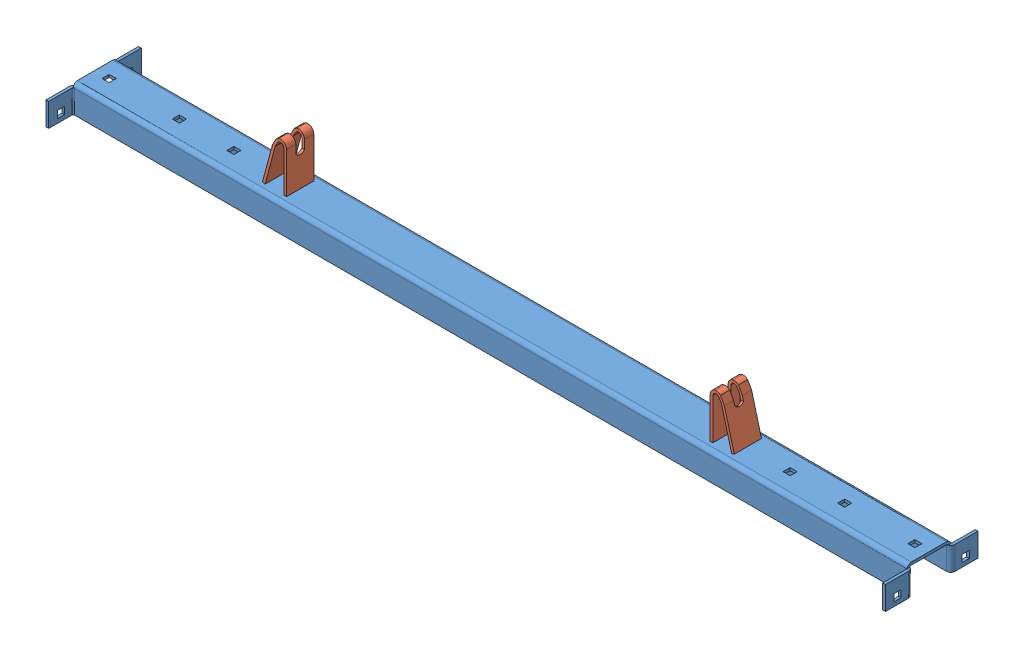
SolidWorks assembly ROULEAU DE GUIDAGE SUPERIEUR 15 DEGRE.SLDASM, configuration Défaut (file format 3800). Lengths in mm.
Overall size (1562 239.06 170).
8 component instances, 5 part files, 19 mates.
Components (placement in the parent):
- Support lateral 15 degre-1: Support lateral 15 degre.SLDPRT [Défaut] at (-845.6944 -66.8778 -446) size (84.76 188.58 80)
- Support lateral 15 degre-2: Support lateral 15 degre.SLDPRT [Défaut] at (716.3056 -66.8778 -526) x (-1 0 0) z (0 0 -1) size (84.76 188.58 80)
- Petit rouleau superieur-1: Petit rouleau superieur.SLDPRT [Défaut] at (353.8512 14.7805 -486) x (0 0 -1) z (0.965926 0.258819 0) size (89 89 316)
- Rouleau superieur central-1: Rouleau superieur central.SLDPRT [Défaut] at (-449.6944 9.6222 -486) x (0 -0.999569 -0.029341) z (1 0 0) size (89 89 796)
- Petit rouleau superieur-2: Petit rouleau superieur.SLDPRT [Défaut] at (-763.3586 89.838 -486) x (0 0 -1) z (0.965926 -0.258819 0) size (89 89 316)
- Traverse 1-1: Traverse 1.SLDPRT [Défaut] at (-64.6944 -77.8778 -526) size (1542 50 170)
- Traverse auge-1: Traverse auge.SLDPRT [Défaut] at (-458.6944 -52.8778 -511) size (44.32 86 50)
- Traverse auge-2: Traverse auge.SLDPRT [Défaut] at (329.3056 -52.8778 -461) x (-1 0 0) z (0 0 -1) size (44.32 86 50)
Mates (geometry in assembly coordinates):
- Distance30: distance = 4 mm anti-aligned: plane of Support lateral 15 degre-1 through (-836.6944 -48.8778 -526) normal (0 -1 0); plane of Traverse 1-1 through (-830.6944 -52.8778 -521) normal (0 1 0)
- Coïncidente7: coincident aligned: plane of Support lateral 15 degre-1 through (-836.6944 -51.8778 -446) normal (0 0 1); plane of Traverse 1-1 through (-830.6944 -102.8778 -446) normal (0 0 1)
- Coïncidente8: coincident aligned: plane of Support lateral 15 degre-1 through (-798.1944 -52.8778 -506) normal (-1 0 0); plane of Traverse 1-1 through (-798.1944 -57.8778 -492.5) normal (-1 0 0)
- Distance31: distance = 4 mm anti-aligned: plane of Support lateral 15 degre-2 through (707.3056 -48.8778 -446) normal (0 -1 0); plane of Traverse 1-1 through (-830.6944 -52.8778 -521) normal (0 1 0)
- Coïncidente10: coincident aligned: plane of Support lateral 15 degre-2 through (707.3056 -51.8778 -446) normal (0 0 1); plane of Traverse 1-1 through (-830.6944 -102.8778 -446) normal (0 0 1)
- Coïncidente11: coincident aligned: plane of Support lateral 15 degre-2 through (668.8056 -52.8778 -466) normal (1 0 0); plane of Traverse 1-1 through (668.8056 -57.8778 -492.5) normal (1 0 0)
- Distance17: distance = 5.5 mm anti-aligned: plane of Support lateral 15 degre-1 through (-779.6944 50.1222 -526) normal (0.965926 -0.258819 0); plane of Petit rouleau superieur-2 through (-763.3586 89.838 -486) normal (-0.965926 0.258819 0)
- Distance23: distance = 0.5 mm anti-aligned: plane of Support lateral 15 degre-1 through (-722.3919 94.1453 -478.5) normal (0 0 -1); plane of Petit rouleau superieur-2 through (-761.0106 110.1921 -479) normal (0 0 1)
- Distance19: distance = 62.5 mm: axis of Rouleau superieur central-1; plane of Traverse 1-1 through (-830.6944 -52.8778 -521) normal (0 1 0)
- Distance20: distance = 5.5 mm anti-aligned: plane of Support lateral 15 degre-2 through (650.3056 50.1222 -446) normal (-0.965926 -0.258819 0); plane of Petit rouleau superieur-1 through (633.9697 89.838 -486) normal (0.965926 0.258819 0)
- Distance24: distance = 0.5 mm anti-aligned: plane of Support lateral 15 degre-2 through (593.003 94.1453 -478.5) normal (0 0 -1); plane of Petit rouleau superieur-1 through (631.7484 109.7192 -479) normal (0 0 1)
- Distance21: distance = 40 mm: axis of Rouleau superieur central-1; plane of Traverse 1-1 through (-830.6944 -102.8778 -526) normal (0 0 -1)
- Distance22: distance = 336 mm aligned: plane of Support lateral 15 degre-1 through (-785.6944 -36.8778 -526) normal (-1 0 0); plane of Rouleau superieur central-1 through (-449.6944 9.6222 -486) normal (-1 0 0)
- Coïncidente28: coincident anti-aligned: plane of Traverse 1-1 through (-830.6944 -52.8778 -521) normal (0 1 0); plane of Traverse auge-2 through (329.3056 -52.8778 -511) normal (0 -1 0)
- Coaxiale2: concentric aligned: cylinder of Petit rouleau superieur-2; cylinder of Traverse auge-1
- Coïncidente36: coincident anti-aligned: plane of Traverse 1-1 through (-830.6944 -52.8778 -521) normal (0 1 0); plane of Traverse auge-1 through (-458.6944 -52.8778 -461) normal (0 -1 0)
- Distance28: distance = 327 mm aligned: plane of Support lateral 15 degre-1 through (-785.6944 -36.8778 -526) normal (-1 0 0); plane of Traverse auge-1 through (-458.6944 -52.8778 -461) normal (-1 0 0)
- Coaxiale3: concentric aligned: cylinder of Petit rouleau superieur-1; cylinder of Traverse auge-2
- Distance29: distance = 327 mm aligned: plane of Support lateral 15 degre-2 through (656.3056 -36.8778 -446) normal (1 0 0); plane of Traverse auge-2 through (329.3056 -52.8778 -511) normal (1 0 0)
